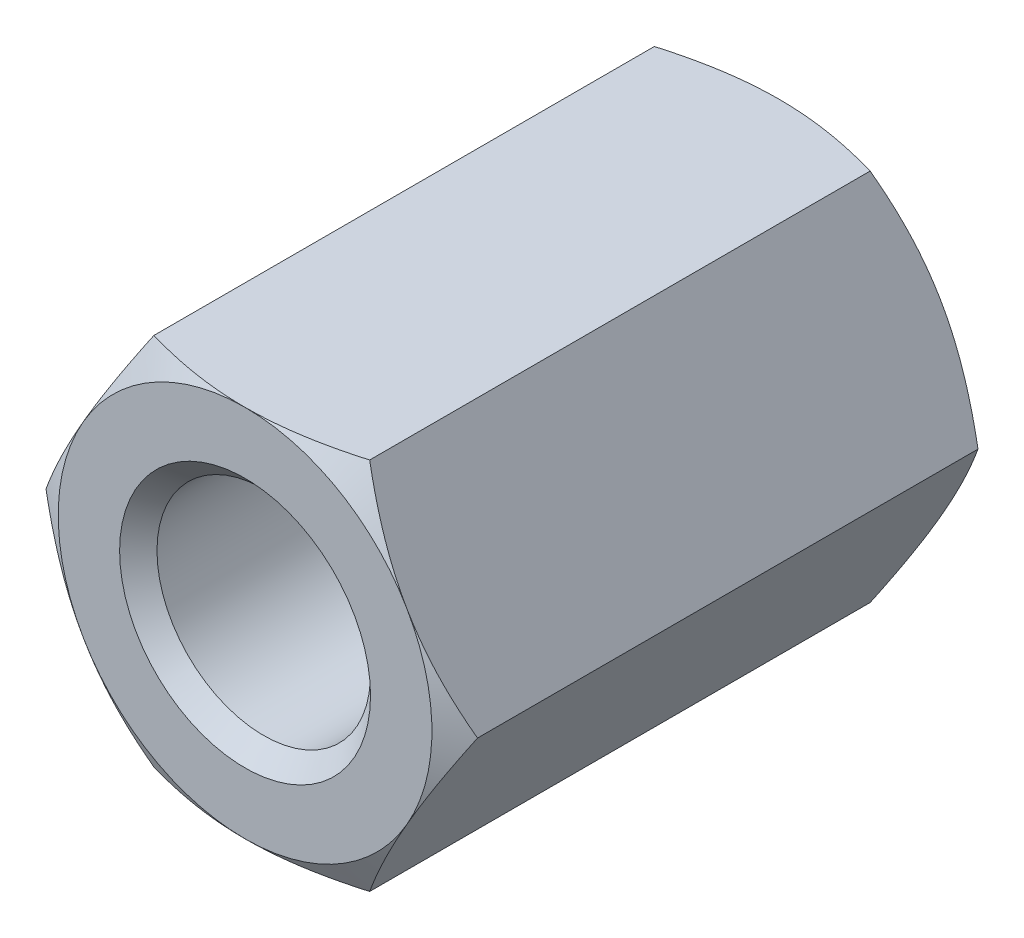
from build123d import *

# Parameters (mm, degrees)
BOSS_EXTRUDE1_DEPTH      = 5
SKETCH2_OUTSIDE_W        = 41.264
SKETCH2_OUTSIDE_H        = 40.182
SKETCH2_OUTSIDE_R        = 3.5
CUT_EXTRUDE1_DEPTH       = 8.320063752
CUT_EXTRUDE1_DRAFT       = -60
SKETCH3_R                = 2
SKETCH3_R_2              = 1.65
CUT_EXTRUDE2_DEPTH       = 5
SKETCH3_2_R              = 1.65
CUT_EXTRUDE3_DEPTH       = 6.05
CHAMFER1_SIZE            = 0.35
MIRROR1_COPY_1_SKETCH_W  = 41.264
MIRROR1_COPY_1_SKETCH_H  = 40.182
MIRROR1_COPY_1_SKETCH_R  = 3.5
MIRROR1_COPY_1_DEPTH     = 8.320063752
MIRROR1_COPY_1_DRAFT     = -60
CHAMFER1_OF_MIRROR1_SIZE = 0.35


with BuildPart() as part:
    # Sketch1 → Boss-Extrude1 (new body)
    with BuildSketch(Plane.XY):
        Polygon((2.020725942, 3.5), (-2.020725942, 3.5), (-4.041451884, 0), (-2.020725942, -3.5), (2.020725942, -3.5), (4.041451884, 0), align=None)
    boss_extrude1 = extrude(amount=-BOSS_EXTRUDE1_DEPTH)


with BuildPart() as cut_extrude1_tool:
    # Sketch2 outside → Cut-Extrude1 (with draft: the straight prism first)
    with BuildSketch(Plane(origin=(0, 0, -5), x_dir=(-1, 0, 0), z_dir=(0, 0, -1))):
        Rectangle(SKETCH2_OUTSIDE_W, SKETCH2_OUTSIDE_H)
        Circle(SKETCH2_OUTSIDE_R, mode=Mode.SUBTRACT)
    extrude(amount=-CUT_EXTRUDE1_DEPTH)
    # Cut-Extrude1: the draft: its side faces are tilted about the plane it starts from
    cut_extrude1_sides = [cut_extrude1_tool.faces().sort_by_distance(p)[0] for p in [
        (0, -20.091, -0.839968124),
        (-20.632, 0, -0.839968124),
        (0, 20.091, -0.839968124),
        (20.632, 0, -0.839968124),
        (3.5, 0, -0.839968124),
    ]]
    draft(cut_extrude1_sides, Plane(origin=(0, 0, -5), x_dir=(-1, 0, 0), z_dir=(0, 0, -1)), CUT_EXTRUDE1_DRAFT)


with BuildPart() as part_1:
    add(part.part)

    # Cut-Extrude1: cut by cut_extrude1_tool
    add(cut_extrude1_tool.part, mode=Mode.SUBTRACT)

    # Sketch3 → Cut-Extrude2 (cut)
    with BuildSketch(Plane(origin=(0, 0, -5), x_dir=(-1, 0, 0), z_dir=(0, 0, -1))):
        Circle(SKETCH3_R)
        Circle(SKETCH3_R_2, mode=Mode.SUBTRACT)
    cut_extrude2 = extrude(amount=-CUT_EXTRUDE2_DEPTH, mode=Mode.SUBTRACT)


with BuildPart() as cut_extrude2_piece_1:
    # of the separate pieces the step leaves, piece 1, a body of its own (cut_extrude2_pieces)
    add(part_1.part.solids().sort_by_distance((2.020725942, 3.5, 0))[0])

    # Chamfer1
    chamfer1_edges = [cut_extrude2_piece_1.edges().sort_by_distance(p)[0] for p in [
        (2, 0, -5),
    ]]
    chamfer(chamfer1_edges, length=CHAMFER1_SIZE)


with BuildPart() as cut_extrude2_piece_2:
    # of the separate pieces the step leaves, piece 2, a body of its own (cut_extrude2_pieces)
    add(part_1.part.solids().sort_by_distance((-1.65, 0, 0))[0])

    # Sketch3_2 → Cut-Extrude3 (cut)
    with BuildSketch(Plane(origin=(0, 0, -5), x_dir=(-1, 0, 0), z_dir=(0, 0, -1))):
        Circle(SKETCH3_2_R)
    cut_extrude3 = extrude(amount=-CUT_EXTRUDE3_DEPTH, mode=Mode.SUBTRACT)


with BuildPart() as cut_extrude2_piece_1_1:
    add(cut_extrude2_piece_1.part)

    # Mirror1: Boss-Extrude1, Cut-Extrude2, Cut-Extrude3 across plane
    add(boss_extrude1.mirror(Plane.XY))
    add(cut_extrude2.mirror(Plane.XY), mode=Mode.SUBTRACT)
    add(cut_extrude3.mirror(Plane.XY), mode=Mode.SUBTRACT)


with BuildPart() as mirror1_copy_1_tool:
    # Mirror1 copy 1 sketch → Mirror1 copy 1 (with draft: the straight prism first)
    with BuildSketch(Plane(origin=(0, 0, 5), x_dir=(-1, 0, 0), z_dir=(0, 0, 1))):
        Rectangle(MIRROR1_COPY_1_SKETCH_W, MIRROR1_COPY_1_SKETCH_H)
        Circle(MIRROR1_COPY_1_SKETCH_R, mode=Mode.SUBTRACT)
    extrude(amount=-MIRROR1_COPY_1_DEPTH)
    # Mirror1 copy 1: the draft: its side faces are tilted about the plane it starts from
    mirror1_copy_1_sides = [mirror1_copy_1_tool.faces().sort_by_distance(p)[0] for p in [
        (0, -20.091, 0.839968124),
        (-20.632, 0, 0.839968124),
        (0, 20.091, 0.839968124),
        (20.632, 0, 0.839968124),
        (3.5, 0, 0.839968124),
    ]]
    draft(mirror1_copy_1_sides, Plane(origin=(0, 0, 5), x_dir=(-1, 0, 0), z_dir=(0, 0, 1)), MIRROR1_COPY_1_DRAFT)


with BuildPart() as cut_extrude2_piece_1_2:
    add(cut_extrude2_piece_1_1.part)

    # Mirror1 copy 1: cut by mirror1_copy_1_tool
    add(mirror1_copy_1_tool.part, mode=Mode.SUBTRACT)

    # Chamfer1 of Mirror1
    chamfer1_of_mirror1_edges = [cut_extrude2_piece_1_2.edges().sort_by_distance(p)[0] for p in [
        (2, 0, 5),
    ]]
    chamfer(chamfer1_of_mirror1_edges, length=CHAMFER1_OF_MIRROR1_SIZE)


solid = cut_extrude2_piece_1_2.part
